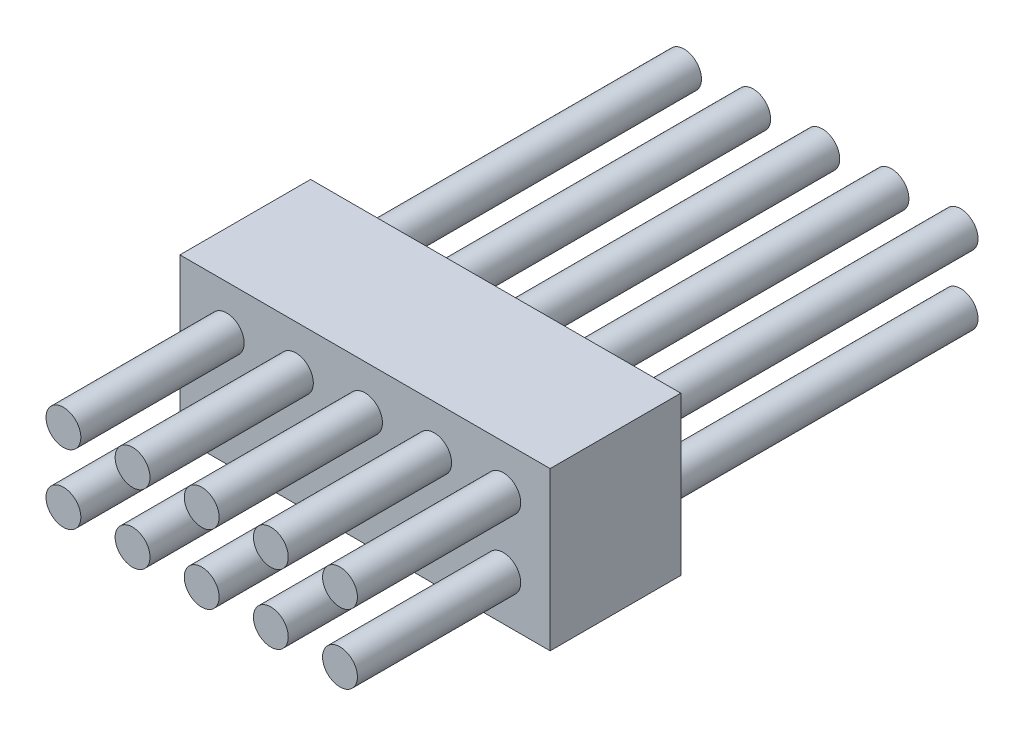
from build123d import *

# Parameters (mm, degrees)
SKETCH1_W           = 6.8
SKETCH1_H           = 2.9
BOSS_EXTRUDE1_DEPTH = 2.4
SKETCH2_R           = 0.32
BOSS_EXTRUDE2_DEPTH = 3
BOSS_EXTRUDE3_START = -8.4
SKETCH2_2_R         = 0.32
BOSS_EXTRUDE3_DEPTH = 6


with BuildPart() as part:
    # Sketch1 → Boss-Extrude1 (new body)
    with BuildSketch(Plane.XY):
        with Locations((3.4, 1.45)):
            Rectangle(SKETCH1_W, SKETCH1_H)
    extrude(amount=BOSS_EXTRUDE1_DEPTH)

    # Sketch2 → Boss-Extrude2 (add)
    with BuildSketch(Plane.XY.offset(2.4)):
        with Locations(Location((0.86, 0.815, 0), (0, 0, 180))):
            Circle(SKETCH2_R)
        with Locations(Location((0.86, 2.085, 0), (0, 0, 180))):
            Circle(SKETCH2_R)
        with Locations(Location((2.13, 2.085, 0), (0, 0, 180))):
            Circle(SKETCH2_R)
        with Locations(Location((2.13, 0.815, 0), (0, 0, 180))):
            Circle(SKETCH2_R)
        with Locations(Location((3.4, 2.085, 0), (0, 0, 180))):
            Circle(SKETCH2_R)
        with Locations(Location((3.4, 0.815, 0), (0, 0, 180))):
            Circle(SKETCH2_R)
        with Locations(Location((4.67, 2.085, 0), (0, 0, 180))):
            Circle(SKETCH2_R)
        with Locations(Location((4.67, 0.815, 0), (0, 0, 180))):
            Circle(SKETCH2_R)
        with Locations(Location((5.94, 2.085, 0), (0, 0, 180))):
            Circle(SKETCH2_R)
        with Locations(Location((5.94, 0.815, 0), (0, 0, 180))):
            Circle(SKETCH2_R)
    extrude(amount=BOSS_EXTRUDE2_DEPTH)

    # Sketch2_2 → Boss-Extrude3 (add)
    with BuildSketch(Plane.XY.offset(2.4).offset(BOSS_EXTRUDE3_START)):
        with Locations(Location((0.86, 0.815, 0), (0, 0, 180))):
            Circle(SKETCH2_2_R)
        with Locations(Location((0.86, 2.085, 0), (0, 0, 180))):
            Circle(SKETCH2_2_R)
        with Locations(Location((2.13, 2.085, 0), (0, 0, 180))):
            Circle(SKETCH2_2_R)
        with Locations(Location((2.13, 0.815, 0), (0, 0, 180))):
            Circle(SKETCH2_2_R)
        with Locations(Location((3.4, 2.085, 0), (0, 0, 180))):
            Circle(SKETCH2_2_R)
        with Locations(Location((3.4, 0.815, 0), (0, 0, 180))):
            Circle(SKETCH2_2_R)
        with Locations(Location((4.67, 2.085, 0), (0, 0, 180))):
            Circle(SKETCH2_2_R)
        with Locations(Location((4.67, 0.815, 0), (0, 0, 180))):
            Circle(SKETCH2_2_R)
        with Locations(Location((5.94, 2.085, 0), (0, 0, 180))):
            Circle(SKETCH2_2_R)
        with Locations(Location((5.94, 0.815, 0), (0, 0, 180))):
            Circle(SKETCH2_2_R)
    extrude(amount=BOSS_EXTRUDE3_DEPTH)


solid = part.part
